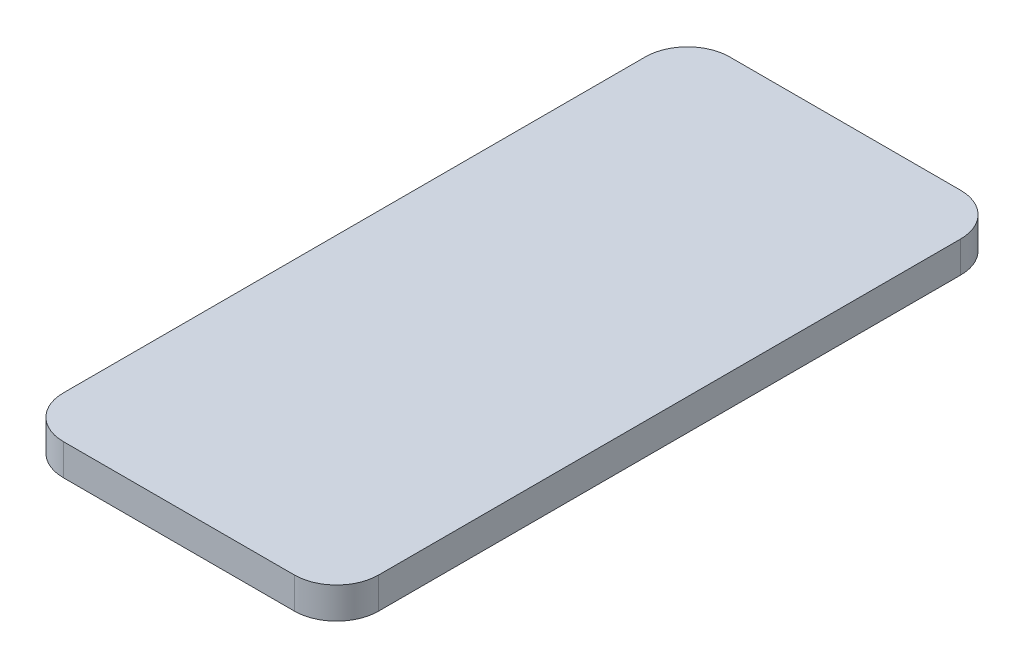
from build123d import *

# Parameters (mm, degrees)
F_01_PHONE_BODY_DEPTH = 7.42


with BuildPart() as part:
    # Sketch 1 → 01_PHONE_BODY (new body)
    with BuildSketch(Plane(origin=(0, 0, 0), x_dir=(1, 0, 0), z_dir=(0, 1, 0))):
        with BuildLine():
            Line((-27.365, 0), (27.365, 0))
            ThreePointArc((27.365, 0), (34.436067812, -2.928932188), (37.365, -10))
            Line((37.365, -10), (37.365, -147.9))
            ThreePointArc((37.365, -147.9), (34.436067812, -154.971067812), (27.365, -157.9))
            Line((27.365, -157.9), (-27.365, -157.9))
            ThreePointArc((-27.365, -157.9), (-34.436067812, -154.971067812), (-37.365, -147.9))
            Line((-37.365, -147.9), (-37.365, -10))
            ThreePointArc((-37.365, -10), (-34.436067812, -2.928932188), (-27.365, 0))
        make_face()
    extrude(amount=-F_01_PHONE_BODY_DEPTH)


solid = part.part
